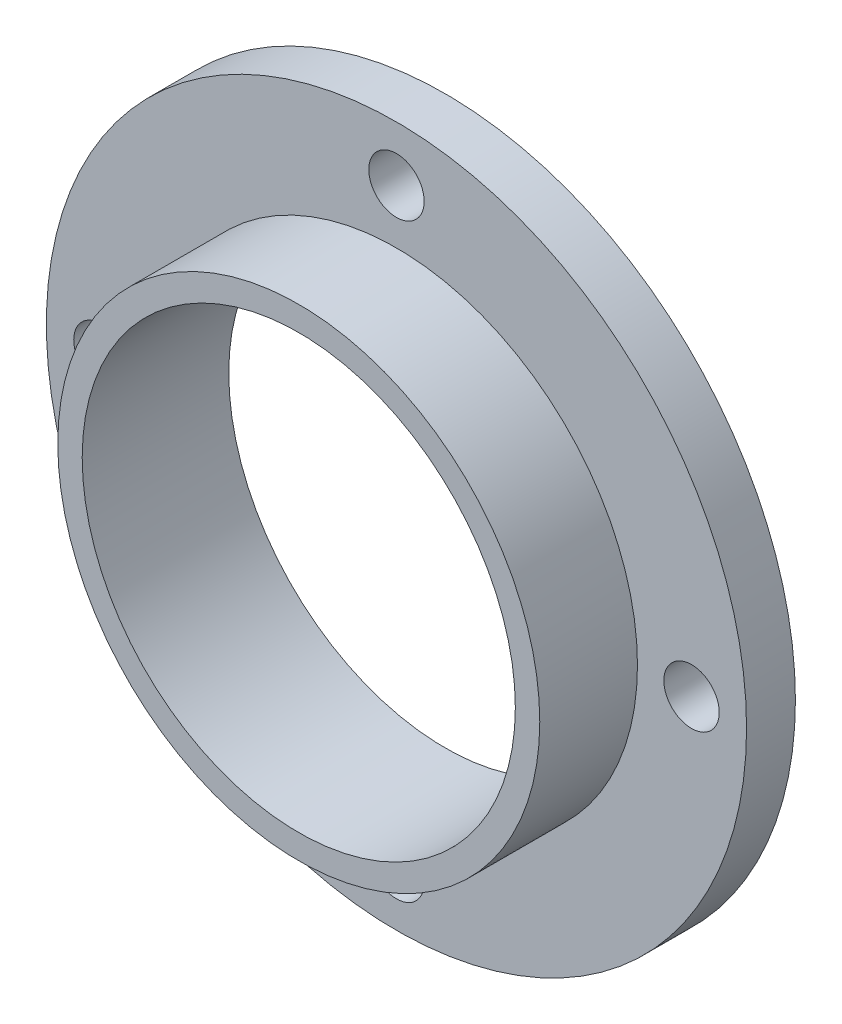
ISO-10303-21;
HEADER;
FILE_DESCRIPTION(('STEP AP214'),'2;1');
FILE_NAME('part.step','',(''),(''),'','','');
FILE_SCHEMA(('AUTOMOTIVE_DESIGN { 1 0 10303 214 1 1 1 1 }'));
ENDSEC;
DATA;
#1=APPLICATION_CONTEXT('core data for automotive mechanical design processes');
#2=APPLICATION_PROTOCOL_DEFINITION('international standard','automotive_design',2000,#1);
#3=PRODUCT_CONTEXT('',#1,'mechanical');
#4=PRODUCT('Part','Part','',(#3));
#5=PRODUCT_RELATED_PRODUCT_CATEGORY('part','',(#4));
#6=PRODUCT_DEFINITION_FORMATION('','',#4);
#7=PRODUCT_DEFINITION_CONTEXT('part definition',#1,'design');
#8=PRODUCT_DEFINITION('design','',#6,#7);
#9=PRODUCT_DEFINITION_SHAPE('','',#8);
#10=(LENGTH_UNIT() NAMED_UNIT(*) SI_UNIT(.MILLI.,.METRE.));
#11=(NAMED_UNIT(*) PLANE_ANGLE_UNIT() SI_UNIT($,.RADIAN.));
#12=(NAMED_UNIT(*) SI_UNIT($,.STERADIAN.) SOLID_ANGLE_UNIT());
#13=UNCERTAINTY_MEASURE_WITH_UNIT(LENGTH_MEASURE(1.E-05),#10,'distance_accuracy_value','');
#14=(GEOMETRIC_REPRESENTATION_CONTEXT(3) GLOBAL_UNCERTAINTY_ASSIGNED_CONTEXT((#13)) GLOBAL_UNIT_ASSIGNED_CONTEXT((#10,
#11,#12)) REPRESENTATION_CONTEXT('',''));
#15=CARTESIAN_POINT('',(0.,0.,0.));
#16=DIRECTION('',(0.,0.,1.));
#17=DIRECTION('',(1.,0.,0.));
#18=AXIS2_PLACEMENT_3D('',#15,#16,#17);
#19=CARTESIAN_POINT('',(0.,0.,9.));
#20=DIRECTION('',(0.,0.,1.));
#21=DIRECTION('',(1.,0.,0.));
#22=AXIS2_PLACEMENT_3D('',#19,#20,#21);
#23=PLANE('',#22);
#24=CARTESIAN_POINT('',(0.,0.,9.));
#25=DIRECTION('',(0.,0.,1.));
#26=DIRECTION('',(1.,0.,0.));
#27=AXIS2_PLACEMENT_3D('',#24,#25,#26);
#28=CIRCLE('',#27,13.3);
#29=CARTESIAN_POINT('',(13.3,0.,9.));
#30=VERTEX_POINT('',#29);
#31=EDGE_CURVE('E38',#30,#30,#28,.T.);
#32=ORIENTED_EDGE('',*,*,#31,.F.);
#33=EDGE_LOOP('',(#32));
#34=FACE_BOUND('',#33,.T.);
#35=CARTESIAN_POINT('',(0.,0.,9.));
#36=DIRECTION('',(0.,0.,1.));
#37=DIRECTION('',(1.,0.,0.));
#38=AXIS2_PLACEMENT_3D('',#35,#36,#37);
#39=CIRCLE('',#38,14.8);
#40=CARTESIAN_POINT('',(14.8,0.,9.));
#41=VERTEX_POINT('',#40);
#42=EDGE_CURVE('E74',#41,#41,#39,.T.);
#43=ORIENTED_EDGE('',*,*,#42,.T.);
#44=EDGE_LOOP('',(#43));
#45=FACE_BOUND('',#44,.T.);
#46=ADVANCED_FACE('F30',(#34,#45),#23,.T.);
#47=CARTESIAN_POINT('',(0.,0.,9.));
#48=DIRECTION('',(0.,0.,-1.));
#49=DIRECTION('',(-1.,0.,0.));
#50=AXIS2_PLACEMENT_3D('',#47,#48,#49);
#51=CYLINDRICAL_SURFACE('',#50,21.5);
#52=CARTESIAN_POINT('',(0.,0.,0.));
#53=DIRECTION('',(0.,0.,1.));
#54=DIRECTION('',(1.,0.,0.));
#55=AXIS2_PLACEMENT_3D('',#52,#53,#54);
#56=CIRCLE('',#55,21.5);
#57=CARTESIAN_POINT('',(21.5,0.,0.));
#58=VERTEX_POINT('',#57);
#59=EDGE_CURVE('E10',#58,#58,#56,.T.);
#60=ORIENTED_EDGE('',*,*,#59,.T.);
#61=EDGE_LOOP('',(#60));
#62=FACE_BOUND('',#61,.T.);
#63=CARTESIAN_POINT('',(0.,0.,3.));
#64=DIRECTION('',(0.,0.,1.));
#65=DIRECTION('',(1.,0.,0.));
#66=AXIS2_PLACEMENT_3D('',#63,#64,#65);
#67=CIRCLE('',#66,21.5);
#68=CARTESIAN_POINT('',(21.5,0.,3.));
#69=VERTEX_POINT('',#68);
#70=EDGE_CURVE('E59',#69,#69,#67,.T.);
#71=ORIENTED_EDGE('',*,*,#70,.F.);
#72=EDGE_LOOP('',(#71));
#73=FACE_BOUND('',#72,.T.);
#74=ADVANCED_FACE('F32',(#62,#73),#51,.T.);
#75=CARTESIAN_POINT('',(0.,18.1198926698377,9.));
#76=DIRECTION('',(0.,0.,-1.));
#77=DIRECTION('',(-1.,0.,0.));
#78=AXIS2_PLACEMENT_3D('',#75,#76,#77);
#79=CYLINDRICAL_SURFACE('',#78,1.7);
#80=CARTESIAN_POINT('',(0.,18.1198926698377,0.));
#81=DIRECTION('',(0.,0.,1.));
#82=DIRECTION('',(1.,0.,0.));
#83=AXIS2_PLACEMENT_3D('',#80,#81,#82);
#84=CIRCLE('',#83,1.7);
#85=CARTESIAN_POINT('',(1.7,18.1198926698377,0.));
#86=VERTEX_POINT('',#85);
#87=EDGE_CURVE('E47',#86,#86,#84,.T.);
#88=ORIENTED_EDGE('',*,*,#87,.F.);
#89=EDGE_LOOP('',(#88));
#90=FACE_BOUND('',#89,.T.);
#91=CARTESIAN_POINT('',(0.,18.1198926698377,3.));
#92=DIRECTION('',(0.,0.,1.));
#93=DIRECTION('',(1.,0.,0.));
#94=AXIS2_PLACEMENT_3D('',#91,#92,#93);
#95=CIRCLE('',#94,1.7);
#96=CARTESIAN_POINT('',(1.7,18.1198926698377,3.));
#97=VERTEX_POINT('',#96);
#98=EDGE_CURVE('E62',#97,#97,#95,.T.);
#99=ORIENTED_EDGE('',*,*,#98,.T.);
#100=EDGE_LOOP('',(#99));
#101=FACE_BOUND('',#100,.T.);
#102=ADVANCED_FACE('F95',(#90,#101),#79,.F.);
#103=CARTESIAN_POINT('',(0.,-18.1198926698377,9.));
#104=DIRECTION('',(0.,0.,-1.));
#105=DIRECTION('',(-1.,0.,0.));
#106=AXIS2_PLACEMENT_3D('',#103,#104,#105);
#107=CYLINDRICAL_SURFACE('',#106,1.7);
#108=CARTESIAN_POINT('',(0.,-18.1198926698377,0.));
#109=DIRECTION('',(0.,0.,1.));
#110=DIRECTION('',(-1.,0.,0.));
#111=AXIS2_PLACEMENT_3D('',#108,#109,#110);
#112=CIRCLE('',#111,1.7);
#113=CARTESIAN_POINT('',(-1.7,-18.1198926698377,0.));
#114=VERTEX_POINT('',#113);
#115=EDGE_CURVE('E50',#114,#114,#112,.T.);
#116=ORIENTED_EDGE('',*,*,#115,.F.);
#117=EDGE_LOOP('',(#116));
#118=FACE_BOUND('',#117,.T.);
#119=CARTESIAN_POINT('',(0.,-18.1198926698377,3.));
#120=DIRECTION('',(0.,0.,1.));
#121=DIRECTION('',(1.,0.,0.));
#122=AXIS2_PLACEMENT_3D('',#119,#120,#121);
#123=CIRCLE('',#122,1.7);
#124=CARTESIAN_POINT('',(1.7,-18.1198926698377,3.));
#125=VERTEX_POINT('',#124);
#126=EDGE_CURVE('E65',#125,#125,#123,.T.);
#127=ORIENTED_EDGE('',*,*,#126,.T.);
#128=EDGE_LOOP('',(#127));
#129=FACE_BOUND('',#128,.T.);
#130=ADVANCED_FACE('F108',(#118,#129),#107,.F.);
#131=CARTESIAN_POINT('',(18.1198926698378,0.,9.));
#132=DIRECTION('',(0.,0.,-1.));
#133=DIRECTION('',(-1.,0.,0.));
#134=AXIS2_PLACEMENT_3D('',#131,#132,#133);
#135=CYLINDRICAL_SURFACE('',#134,1.7);
#136=CARTESIAN_POINT('',(18.1198926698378,0.,0.));
#137=DIRECTION('',(0.,0.,1.));
#138=DIRECTION('',(1.,0.,0.));
#139=AXIS2_PLACEMENT_3D('',#136,#137,#138);
#140=CIRCLE('',#139,1.7);
#141=CARTESIAN_POINT('',(19.8198926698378,0.,0.));
#142=VERTEX_POINT('',#141);
#143=EDGE_CURVE('E53',#142,#142,#140,.T.);
#144=ORIENTED_EDGE('',*,*,#143,.F.);
#145=EDGE_LOOP('',(#144));
#146=FACE_BOUND('',#145,.T.);
#147=CARTESIAN_POINT('',(18.1198926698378,0.,3.));
#148=DIRECTION('',(0.,0.,1.));
#149=DIRECTION('',(1.,0.,0.));
#150=AXIS2_PLACEMENT_3D('',#147,#148,#149);
#151=CIRCLE('',#150,1.7);
#152=CARTESIAN_POINT('',(19.8198926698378,0.,3.));
#153=VERTEX_POINT('',#152);
#154=EDGE_CURVE('E68',#153,#153,#151,.T.);
#155=ORIENTED_EDGE('',*,*,#154,.T.);
#156=EDGE_LOOP('',(#155));
#157=FACE_BOUND('',#156,.T.);
#158=ADVANCED_FACE('F112',(#146,#157),#135,.F.);
#159=CARTESIAN_POINT('',(-18.1198926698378,0.,9.));
#160=DIRECTION('',(0.,0.,-1.));
#161=DIRECTION('',(-1.,0.,0.));
#162=AXIS2_PLACEMENT_3D('',#159,#160,#161);
#163=CYLINDRICAL_SURFACE('',#162,1.7);
#164=CARTESIAN_POINT('',(-18.1198926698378,0.,0.));
#165=DIRECTION('',(0.,0.,1.));
#166=DIRECTION('',(-1.,0.,0.));
#167=AXIS2_PLACEMENT_3D('',#164,#165,#166);
#168=CIRCLE('',#167,1.7);
#169=CARTESIAN_POINT('',(-19.8198926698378,0.,0.));
#170=VERTEX_POINT('',#169);
#171=EDGE_CURVE('E56',#170,#170,#168,.T.);
#172=ORIENTED_EDGE('',*,*,#171,.F.);
#173=EDGE_LOOP('',(#172));
#174=FACE_BOUND('',#173,.T.);
#175=CARTESIAN_POINT('',(-18.1198926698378,0.,3.));
#176=DIRECTION('',(0.,0.,1.));
#177=DIRECTION('',(1.,0.,0.));
#178=AXIS2_PLACEMENT_3D('',#175,#176,#177);
#179=CIRCLE('',#178,1.7);
#180=CARTESIAN_POINT('',(-16.4198926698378,0.,3.));
#181=VERTEX_POINT('',#180);
#182=EDGE_CURVE('E34',#181,#181,#179,.T.);
#183=ORIENTED_EDGE('',*,*,#182,.T.);
#184=EDGE_LOOP('',(#183));
#185=FACE_BOUND('',#184,.T.);
#186=ADVANCED_FACE('F101',(#174,#185),#163,.F.);
#187=CARTESIAN_POINT('',(0.,0.,0.));
#188=DIRECTION('',(0.,0.,1.));
#189=DIRECTION('',(1.,0.,0.));
#190=AXIS2_PLACEMENT_3D('',#187,#188,#189);
#191=PLANE('',#190);
#192=ORIENTED_EDGE('',*,*,#143,.T.);
#193=EDGE_LOOP('',(#192));
#194=FACE_BOUND('',#193,.T.);
#195=ORIENTED_EDGE('',*,*,#87,.T.);
#196=EDGE_LOOP('',(#195));
#197=FACE_BOUND('',#196,.T.);
#198=ORIENTED_EDGE('',*,*,#59,.F.);
#199=EDGE_LOOP('',(#198));
#200=FACE_BOUND('',#199,.T.);
#201=CARTESIAN_POINT('',(0.,0.,0.));
#202=DIRECTION('',(0.,0.,1.));
#203=DIRECTION('',(1.,0.,0.));
#204=AXIS2_PLACEMENT_3D('',#201,#202,#203);
#205=CIRCLE('',#204,13.3);
#206=CARTESIAN_POINT('',(13.3,0.,0.));
#207=VERTEX_POINT('',#206);
#208=EDGE_CURVE('E42',#207,#207,#205,.T.);
#209=ORIENTED_EDGE('',*,*,#208,.T.);
#210=EDGE_LOOP('',(#209));
#211=FACE_BOUND('',#210,.T.);
#212=ORIENTED_EDGE('',*,*,#115,.T.);
#213=EDGE_LOOP('',(#212));
#214=FACE_BOUND('',#213,.T.);
#215=ORIENTED_EDGE('',*,*,#171,.T.);
#216=EDGE_LOOP('',(#215));
#217=FACE_BOUND('',#216,.T.);
#218=ADVANCED_FACE('F98',(#194,#197,#200,#211,#214,#217),#191,.F.);
#219=CARTESIAN_POINT('',(0.,0.,9.));
#220=DIRECTION('',(0.,0.,-1.));
#221=DIRECTION('',(-1.,0.,0.));
#222=AXIS2_PLACEMENT_3D('',#219,#220,#221);
#223=CYLINDRICAL_SURFACE('',#222,13.3);
#224=ORIENTED_EDGE('',*,*,#31,.T.);
#225=EDGE_LOOP('',(#224));
#226=FACE_BOUND('',#225,.T.);
#227=ORIENTED_EDGE('',*,*,#208,.F.);
#228=EDGE_LOOP('',(#227));
#229=FACE_BOUND('',#228,.T.);
#230=ADVANCED_FACE('F87',(#226,#229),#223,.F.);
#231=CARTESIAN_POINT('',(0.,0.,3.));
#232=DIRECTION('',(0.,0.,1.));
#233=DIRECTION('',(1.,0.,0.));
#234=AXIS2_PLACEMENT_3D('',#231,#232,#233);
#235=PLANE('',#234);
#236=CARTESIAN_POINT('',(0.,0.,3.));
#237=DIRECTION('',(0.,0.,1.));
#238=DIRECTION('',(1.,0.,0.));
#239=AXIS2_PLACEMENT_3D('',#236,#237,#238);
#240=CIRCLE('',#239,14.8);
#241=CARTESIAN_POINT('',(14.8,0.,3.));
#242=VERTEX_POINT('',#241);
#243=EDGE_CURVE('E71',#242,#242,#240,.T.);
#244=ORIENTED_EDGE('',*,*,#243,.F.);
#245=EDGE_LOOP('',(#244));
#246=FACE_BOUND('',#245,.T.);
#247=ORIENTED_EDGE('',*,*,#182,.F.);
#248=EDGE_LOOP('',(#247));
#249=FACE_BOUND('',#248,.T.);
#250=ORIENTED_EDGE('',*,*,#154,.F.);
#251=EDGE_LOOP('',(#250));
#252=FACE_BOUND('',#251,.T.);
#253=ORIENTED_EDGE('',*,*,#126,.F.);
#254=EDGE_LOOP('',(#253));
#255=FACE_BOUND('',#254,.T.);
#256=ORIENTED_EDGE('',*,*,#98,.F.);
#257=EDGE_LOOP('',(#256));
#258=FACE_BOUND('',#257,.T.);
#259=ORIENTED_EDGE('',*,*,#70,.T.);
#260=EDGE_LOOP('',(#259));
#261=FACE_BOUND('',#260,.T.);
#262=ADVANCED_FACE('F81',(#246,#249,#252,#255,#258,#261),#235,.T.);
#263=CARTESIAN_POINT('',(0.,0.,3.));
#264=DIRECTION('',(0.,0.,1.));
#265=DIRECTION('',(1.,0.,0.));
#266=AXIS2_PLACEMENT_3D('',#263,#264,#265);
#267=CYLINDRICAL_SURFACE('',#266,14.8);
#268=ORIENTED_EDGE('',*,*,#243,.T.);
#269=EDGE_LOOP('',(#268));
#270=FACE_BOUND('',#269,.T.);
#271=ORIENTED_EDGE('',*,*,#42,.F.);
#272=EDGE_LOOP('',(#271));
#273=FACE_BOUND('',#272,.T.);
#274=ADVANCED_FACE('F79',(#270,#273),#267,.T.);
#275=CLOSED_SHELL('',(#46,#74,#102,#130,#158,#186,#218,#230,#262,#274));
#276=MANIFOLD_SOLID_BREP('B2',#275);
#277=ADVANCED_BREP_SHAPE_REPRESENTATION('',(#18,#276),#14);
#278=SHAPE_DEFINITION_REPRESENTATION(#9,#277);
ENDSEC;
END-ISO-10303-21;
